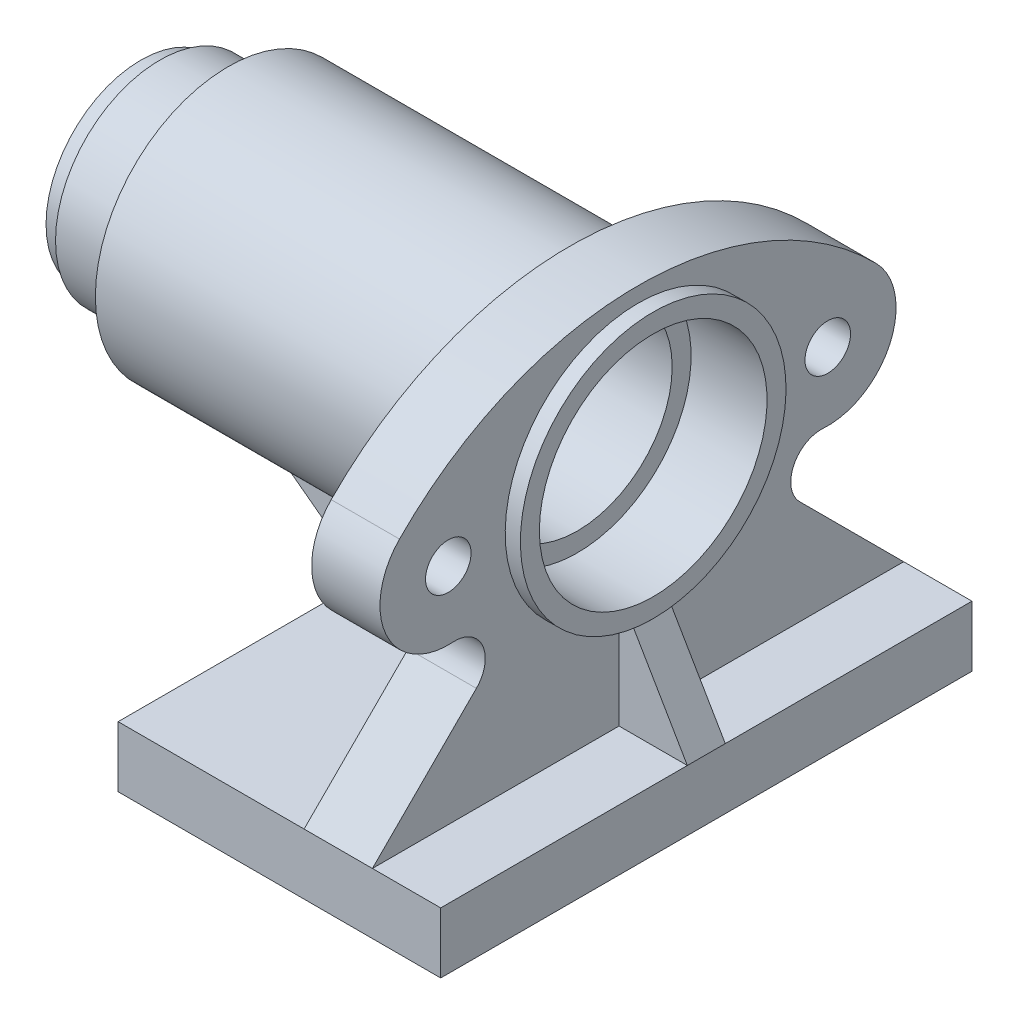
ISO-10303-21;
HEADER;
FILE_DESCRIPTION(('STEP AP214'),'2;1');
FILE_NAME('part.step','',(''),(''),'','','');
FILE_SCHEMA(('AUTOMOTIVE_DESIGN { 1 0 10303 214 1 1 1 1 }'));
ENDSEC;
DATA;
#1=APPLICATION_CONTEXT('core data for automotive mechanical design processes');
#2=APPLICATION_PROTOCOL_DEFINITION('international standard','automotive_design',2000,#1);
#3=PRODUCT_CONTEXT('',#1,'mechanical');
#4=PRODUCT('Part','Part','',(#3));
#5=PRODUCT_RELATED_PRODUCT_CATEGORY('part','',(#4));
#6=PRODUCT_DEFINITION_FORMATION('','',#4);
#7=PRODUCT_DEFINITION_CONTEXT('part definition',#1,'design');
#8=PRODUCT_DEFINITION('design','',#6,#7);
#9=PRODUCT_DEFINITION_SHAPE('','',#8);
#10=(LENGTH_UNIT() NAMED_UNIT(*) SI_UNIT(.MILLI.,.METRE.));
#11=(NAMED_UNIT(*) PLANE_ANGLE_UNIT() SI_UNIT($,.RADIAN.));
#12=(NAMED_UNIT(*) SI_UNIT($,.STERADIAN.) SOLID_ANGLE_UNIT());
#13=UNCERTAINTY_MEASURE_WITH_UNIT(LENGTH_MEASURE(1.E-05),#10,'distance_accuracy_value','');
#14=(GEOMETRIC_REPRESENTATION_CONTEXT(3) GLOBAL_UNCERTAINTY_ASSIGNED_CONTEXT((#13)) GLOBAL_UNIT_ASSIGNED_CONTEXT((#10,
#11,#12)) REPRESENTATION_CONTEXT('',''));
#15=CARTESIAN_POINT('',(0.,0.,0.));
#16=DIRECTION('',(0.,0.,1.));
#17=DIRECTION('',(1.,0.,0.));
#18=AXIS2_PLACEMENT_3D('',#15,#16,#17);
#19=CARTESIAN_POINT('',(0.,16.,70.));
#20=DIRECTION('',(0.,-1.,0.));
#21=DIRECTION('',(1.,0.,0.));
#22=AXIS2_PLACEMENT_3D('',#19,#20,#21);
#23=PLANE('',#22);
#24=DIRECTION('',(-1.,0.,0.));
#25=VECTOR('',#24,1.);
#26=CARTESIAN_POINT('',(0.,16.,-5.));
#27=LINE('',#26,#25);
#28=CARTESIAN_POINT('',(-36.,16.,-5.));
#29=VERTEX_POINT('',#28);
#30=CARTESIAN_POINT('',(-85.,16.,-5.));
#31=VERTEX_POINT('',#30);
#32=EDGE_CURVE('E196',#29,#31,#27,.T.);
#33=ORIENTED_EDGE('',*,*,#32,.F.);
#34=DIRECTION('',(0.,0.,-1.));
#35=VECTOR('',#34,1.);
#36=CARTESIAN_POINT('',(-36.,16.,70.));
#37=LINE('',#36,#35);
#38=CARTESIAN_POINT('',(-36.,16.,-70.));
#39=VERTEX_POINT('',#38);
#40=EDGE_CURVE('E37',#29,#39,#37,.T.);
#41=ORIENTED_EDGE('',*,*,#40,.T.);
#42=DIRECTION('',(-1.,0.,0.));
#43=VECTOR('',#42,1.);
#44=CARTESIAN_POINT('',(0.,16.,-70.));
#45=LINE('',#44,#43);
#46=CARTESIAN_POINT('',(-85.,16.,-70.));
#47=VERTEX_POINT('',#46);
#48=EDGE_CURVE('E385',#39,#47,#45,.T.);
#49=ORIENTED_EDGE('',*,*,#48,.T.);
#50=DIRECTION('',(0.,0.,-1.));
#51=VECTOR('',#50,1.);
#52=CARTESIAN_POINT('',(-85.,16.,70.));
#53=LINE('',#52,#51);
#54=EDGE_CURVE('E50',#31,#47,#53,.T.);
#55=ORIENTED_EDGE('',*,*,#54,.F.);
#56=EDGE_LOOP('',(#33,#41,#49,#55));
#57=FACE_BOUND('',#56,.T.);
#58=ADVANCED_FACE('F33',(#57),#23,.F.);
#59=DIRECTION('',(-1.,0.,0.));
#60=VECTOR('',#59,1.);
#61=CARTESIAN_POINT('',(0.,16.,-5.));
#62=LINE('',#61,#60);
#63=CARTESIAN_POINT('',(0.,16.,-5.));
#64=VERTEX_POINT('',#63);
#65=CARTESIAN_POINT('',(-18.,16.,-5.));
#66=VERTEX_POINT('',#65);
#67=EDGE_CURVE('E219',#64,#66,#62,.T.);
#68=ORIENTED_EDGE('',*,*,#67,.F.);
#69=DIRECTION('',(0.,0.,-1.));
#70=VECTOR('',#69,1.);
#71=CARTESIAN_POINT('',(0.,16.,70.));
#72=LINE('',#71,#70);
#73=CARTESIAN_POINT('',(0.,16.,-70.));
#74=VERTEX_POINT('',#73);
#75=EDGE_CURVE('E401',#64,#74,#72,.T.);
#76=ORIENTED_EDGE('',*,*,#75,.T.);
#77=CARTESIAN_POINT('',(-18.,16.,-70.));
#78=VERTEX_POINT('',#77);
#79=EDGE_CURVE('E388',#74,#78,#45,.T.);
#80=ORIENTED_EDGE('',*,*,#79,.T.);
#81=DIRECTION('',(0.,0.,-1.));
#82=VECTOR('',#81,1.);
#83=CARTESIAN_POINT('',(-18.,16.,70.));
#84=LINE('',#83,#82);
#85=EDGE_CURVE('E288',#66,#78,#84,.T.);
#86=ORIENTED_EDGE('',*,*,#85,.F.);
#87=EDGE_LOOP('',(#68,#76,#80,#86));
#88=FACE_BOUND('',#87,.T.);
#89=ADVANCED_FACE('F499',(#88),#23,.F.);
#90=CARTESIAN_POINT('',(0.,16.,70.));
#91=VERTEX_POINT('',#90);
#92=CARTESIAN_POINT('',(0.,16.,5.));
#93=VERTEX_POINT('',#92);
#94=EDGE_CURVE('E402',#91,#93,#72,.T.);
#95=ORIENTED_EDGE('',*,*,#94,.T.);
#96=DIRECTION('',(-1.,0.,0.));
#97=VECTOR('',#96,1.);
#98=CARTESIAN_POINT('',(0.,16.,5.));
#99=LINE('',#98,#97);
#100=CARTESIAN_POINT('',(-18.,16.,5.));
#101=VERTEX_POINT('',#100);
#102=EDGE_CURVE('E230',#93,#101,#99,.T.);
#103=ORIENTED_EDGE('',*,*,#102,.T.);
#104=CARTESIAN_POINT('',(-18.,16.,70.));
#105=VERTEX_POINT('',#104);
#106=EDGE_CURVE('E325',#105,#101,#84,.T.);
#107=ORIENTED_EDGE('',*,*,#106,.F.);
#108=DIRECTION('',(-1.,0.,0.));
#109=VECTOR('',#108,1.);
#110=CARTESIAN_POINT('',(0.,16.,70.));
#111=LINE('',#110,#109);
#112=EDGE_CURVE('E382',#91,#105,#111,.T.);
#113=ORIENTED_EDGE('',*,*,#112,.F.);
#114=EDGE_LOOP('',(#95,#103,#107,#113));
#115=FACE_BOUND('',#114,.T.);
#116=ADVANCED_FACE('F466',(#115),#23,.F.);
#117=CARTESIAN_POINT('',(-85.,0.,70.));
#118=DIRECTION('',(0.,1.,0.));
#119=DIRECTION('',(-1.,0.,0.));
#120=AXIS2_PLACEMENT_3D('',#117,#118,#119);
#121=PLANE('',#120);
#122=DIRECTION('',(1.,0.,0.));
#123=VECTOR('',#122,1.);
#124=CARTESIAN_POINT('',(-85.,0.,-70.));
#125=LINE('',#124,#123);
#126=CARTESIAN_POINT('',(-85.,0.,-70.));
#127=VERTEX_POINT('',#126);
#128=CARTESIAN_POINT('',(0.,0.,-70.));
#129=VERTEX_POINT('',#128);
#130=EDGE_CURVE('E316',#127,#129,#125,.T.);
#131=ORIENTED_EDGE('',*,*,#130,.T.);
#132=DIRECTION('',(0.,0.,-1.));
#133=VECTOR('',#132,1.);
#134=CARTESIAN_POINT('',(0.,0.,70.));
#135=LINE('',#134,#133);
#136=CARTESIAN_POINT('',(0.,0.,70.));
#137=VERTEX_POINT('',#136);
#138=EDGE_CURVE('E43',#137,#129,#135,.T.);
#139=ORIENTED_EDGE('',*,*,#138,.F.);
#140=DIRECTION('',(1.,0.,0.));
#141=VECTOR('',#140,1.);
#142=CARTESIAN_POINT('',(-85.,0.,70.));
#143=LINE('',#142,#141);
#144=CARTESIAN_POINT('',(-85.,0.,70.));
#145=VERTEX_POINT('',#144);
#146=EDGE_CURVE('E372',#145,#137,#143,.T.);
#147=ORIENTED_EDGE('',*,*,#146,.F.);
#148=DIRECTION('',(0.,0.,-1.));
#149=VECTOR('',#148,1.);
#150=CARTESIAN_POINT('',(-85.,0.,70.));
#151=LINE('',#150,#149);
#152=EDGE_CURVE('E397',#145,#127,#151,.T.);
#153=ORIENTED_EDGE('',*,*,#152,.T.);
#154=EDGE_LOOP('',(#131,#139,#147,#153));
#155=FACE_BOUND('',#154,.T.);
#156=ADVANCED_FACE('F35',(#155),#121,.F.);
#157=CARTESIAN_POINT('',(0.,0.,70.));
#158=DIRECTION('',(-1.,0.,0.));
#159=DIRECTION('',(0.,-1.,0.));
#160=AXIS2_PLACEMENT_3D('',#157,#158,#159);
#161=PLANE('',#160);
#162=ORIENTED_EDGE('',*,*,#138,.T.);
#163=DIRECTION('',(0.,1.,0.));
#164=VECTOR('',#163,1.);
#165=CARTESIAN_POINT('',(0.,0.,-70.));
#166=LINE('',#165,#164);
#167=EDGE_CURVE('E389',#129,#74,#166,.T.);
#168=ORIENTED_EDGE('',*,*,#167,.T.);
#169=ORIENTED_EDGE('',*,*,#75,.F.);
#170=DIRECTION('',(0.,0.,-1.));
#171=VECTOR('',#170,1.);
#172=CARTESIAN_POINT('',(0.,16.,70.));
#173=LINE('',#172,#171);
#174=EDGE_CURVE('E240',#93,#64,#173,.T.);
#175=ORIENTED_EDGE('',*,*,#174,.F.);
#176=ORIENTED_EDGE('',*,*,#94,.F.);
#177=DIRECTION('',(0.,1.,0.));
#178=VECTOR('',#177,1.);
#179=CARTESIAN_POINT('',(0.,0.,70.));
#180=LINE('',#179,#178);
#181=EDGE_CURVE('E375',#137,#91,#180,.T.);
#182=ORIENTED_EDGE('',*,*,#181,.F.);
#183=EDGE_LOOP('',(#162,#168,#169,#175,#176,#182));
#184=FACE_BOUND('',#183,.T.);
#185=ADVANCED_FACE('F408',(#184),#161,.F.);
#186=CARTESIAN_POINT('',(-36.,16.,70.));
#187=VERTEX_POINT('',#186);
#188=CARTESIAN_POINT('',(-36.,16.,5.));
#189=VERTEX_POINT('',#188);
#190=EDGE_CURVE('E296',#187,#189,#37,.T.);
#191=ORIENTED_EDGE('',*,*,#190,.T.);
#192=DIRECTION('',(-1.,0.,0.));
#193=VECTOR('',#192,1.);
#194=CARTESIAN_POINT('',(0.,16.,5.));
#195=LINE('',#194,#193);
#196=CARTESIAN_POINT('',(-85.,16.,5.));
#197=VERTEX_POINT('',#196);
#198=EDGE_CURVE('E58',#189,#197,#195,.T.);
#199=ORIENTED_EDGE('',*,*,#198,.T.);
#200=CARTESIAN_POINT('',(-85.,16.,70.));
#201=VERTEX_POINT('',#200);
#202=EDGE_CURVE('E399',#201,#197,#53,.T.);
#203=ORIENTED_EDGE('',*,*,#202,.F.);
#204=EDGE_CURVE('E300',#187,#201,#111,.T.);
#205=ORIENTED_EDGE('',*,*,#204,.F.);
#206=EDGE_LOOP('',(#191,#199,#203,#205));
#207=FACE_BOUND('',#206,.T.);
#208=ADVANCED_FACE('F501',(#207),#23,.F.);
#209=CARTESIAN_POINT('',(-85.,16.,70.));
#210=DIRECTION('',(1.,0.,0.));
#211=DIRECTION('',(0.,0.,-1.));
#212=AXIS2_PLACEMENT_3D('',#209,#210,#211);
#213=PLANE('',#212);
#214=ORIENTED_EDGE('',*,*,#202,.T.);
#215=DIRECTION('',(0.,0.,1.));
#216=VECTOR('',#215,1.);
#217=CARTESIAN_POINT('',(-85.,16.,70.));
#218=LINE('',#217,#216);
#219=EDGE_CURVE('E213',#197,#31,#218,.F.);
#220=ORIENTED_EDGE('',*,*,#219,.T.);
#221=ORIENTED_EDGE('',*,*,#54,.T.);
#222=DIRECTION('',(0.,-1.,0.));
#223=VECTOR('',#222,1.);
#224=CARTESIAN_POINT('',(-85.,16.,-70.));
#225=LINE('',#224,#223);
#226=EDGE_CURVE('E376',#47,#127,#225,.T.);
#227=ORIENTED_EDGE('',*,*,#226,.T.);
#228=ORIENTED_EDGE('',*,*,#152,.F.);
#229=DIRECTION('',(0.,-1.,0.));
#230=VECTOR('',#229,1.);
#231=CARTESIAN_POINT('',(-85.,16.,70.));
#232=LINE('',#231,#230);
#233=EDGE_CURVE('E379',#201,#145,#232,.T.);
#234=ORIENTED_EDGE('',*,*,#233,.F.);
#235=EDGE_LOOP('',(#214,#220,#221,#227,#228,#234));
#236=FACE_BOUND('',#235,.T.);
#237=ADVANCED_FACE('F423',(#236),#213,.F.);
#238=CARTESIAN_POINT('',(0.,0.,70.));
#239=DIRECTION('',(0.,0.,1.));
#240=DIRECTION('',(1.,0.,0.));
#241=AXIS2_PLACEMENT_3D('',#238,#239,#240);
#242=PLANE('',#241);
#243=ORIENTED_EDGE('',*,*,#146,.T.);
#244=ORIENTED_EDGE('',*,*,#181,.T.);
#245=ORIENTED_EDGE('',*,*,#112,.T.);
#246=DIRECTION('',(1.,0.,0.));
#247=VECTOR('',#246,1.);
#248=CARTESIAN_POINT('',(-36.,16.,70.));
#249=LINE('',#248,#247);
#250=EDGE_CURVE('E314',#187,#105,#249,.T.);
#251=ORIENTED_EDGE('',*,*,#250,.F.);
#252=ORIENTED_EDGE('',*,*,#204,.T.);
#253=ORIENTED_EDGE('',*,*,#233,.T.);
#254=EDGE_LOOP('',(#243,#244,#245,#251,#252,#253));
#255=FACE_BOUND('',#254,.T.);
#256=ADVANCED_FACE('F469',(#255),#242,.T.);
#257=CARTESIAN_POINT('',(0.,0.,-70.));
#258=DIRECTION('',(0.,0.,1.));
#259=DIRECTION('',(1.,0.,0.));
#260=AXIS2_PLACEMENT_3D('',#257,#258,#259);
#261=PLANE('',#260);
#262=ORIENTED_EDGE('',*,*,#130,.F.);
#263=ORIENTED_EDGE('',*,*,#226,.F.);
#264=ORIENTED_EDGE('',*,*,#48,.F.);
#265=DIRECTION('',(1.,0.,0.));
#266=VECTOR('',#265,1.);
#267=CARTESIAN_POINT('',(-36.,16.,-70.));
#268=LINE('',#267,#266);
#269=EDGE_CURVE('E307',#39,#78,#268,.T.);
#270=ORIENTED_EDGE('',*,*,#269,.T.);
#271=ORIENTED_EDGE('',*,*,#79,.F.);
#272=ORIENTED_EDGE('',*,*,#167,.F.);
#273=EDGE_LOOP('',(#262,#263,#264,#270,#271,#272));
#274=FACE_BOUND('',#273,.T.);
#275=ADVANCED_FACE('F417',(#274),#261,.F.);
#276=CARTESIAN_POINT('',(-36.,16.,70.));
#277=DIRECTION('',(0.,0.707106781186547,0.707106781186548));
#278=DIRECTION('',(0.,-0.707106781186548,0.707106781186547));
#279=AXIS2_PLACEMENT_3D('',#276,#277,#278);
#280=PLANE('',#279);
#281=DIRECTION('',(0.,-0.707106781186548,0.707106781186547));
#282=VECTOR('',#281,1.);
#283=CARTESIAN_POINT('',(-18.,16.,70.));
#284=LINE('',#283,#282);
#285=CARTESIAN_POINT('',(-18.,43.4017639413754,42.5982360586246));
#286=VERTEX_POINT('',#285);
#287=EDGE_CURVE('E330',#286,#105,#284,.T.);
#288=ORIENTED_EDGE('',*,*,#287,.F.);
#289=DIRECTION('',(1.,0.,0.));
#290=VECTOR('',#289,1.);
#291=CARTESIAN_POINT('',(-36.,43.4017639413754,42.5982360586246));
#292=LINE('',#291,#290);
#293=CARTESIAN_POINT('',(-36.,43.4017639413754,42.5982360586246));
#294=VERTEX_POINT('',#293);
#295=EDGE_CURVE('E317',#294,#286,#292,.T.);
#296=ORIENTED_EDGE('',*,*,#295,.F.);
#297=DIRECTION('',(0.,-0.707106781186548,0.707106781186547));
#298=VECTOR('',#297,1.);
#299=CARTESIAN_POINT('',(-36.,16.,70.));
#300=LINE('',#299,#298);
#301=EDGE_CURVE('E311',#294,#187,#300,.T.);
#302=ORIENTED_EDGE('',*,*,#301,.T.);
#303=ORIENTED_EDGE('',*,*,#250,.T.);
#304=EDGE_LOOP('',(#288,#296,#302,#303));
#305=FACE_BOUND('',#304,.T.);
#306=ADVANCED_FACE('F459',(#305),#280,.T.);
#307=CARTESIAN_POINT('',(-36.,49.0586181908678,48.255090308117));
#308=DIRECTION('',(1.,0.,0.));
#309=DIRECTION('',(0.,0.,-1.));
#310=AXIS2_PLACEMENT_3D('',#307,#308,#309);
#311=CYLINDRICAL_SURFACE('',#310,8.);
#312=CARTESIAN_POINT('',(-18.,49.0586181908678,48.255090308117));
#313=DIRECTION('',(-1.,0.,0.));
#314=DIRECTION('',(0.,0.,-1.));
#315=AXIS2_PLACEMENT_3D('',#312,#313,#314);
#316=CIRCLE('',#315,8.);
#317=CARTESIAN_POINT('',(-18.,57.0405818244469,48.7919855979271));
#318=VERTEX_POINT('',#317);
#319=EDGE_CURVE('E358',#318,#286,#316,.T.);
#320=ORIENTED_EDGE('',*,*,#319,.F.);
#321=DIRECTION('',(1.,0.,0.));
#322=VECTOR('',#321,1.);
#323=CARTESIAN_POINT('',(-36.,57.0405818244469,48.7919855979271));
#324=LINE('',#323,#322);
#325=CARTESIAN_POINT('',(-36.,57.0405818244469,48.7919855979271));
#326=VERTEX_POINT('',#325);
#327=EDGE_CURVE('E362',#326,#318,#324,.T.);
#328=ORIENTED_EDGE('',*,*,#327,.F.);
#329=CARTESIAN_POINT('',(-36.,49.0586181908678,48.255090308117));
#330=DIRECTION('',(-1.,0.,0.));
#331=DIRECTION('',(0.,0.,-1.));
#332=AXIS2_PLACEMENT_3D('',#329,#330,#331);
#333=CIRCLE('',#332,8.);
#334=EDGE_CURVE('E322',#326,#294,#333,.T.);
#335=ORIENTED_EDGE('',*,*,#334,.T.);
#336=ORIENTED_EDGE('',*,*,#295,.T.);
#337=EDGE_LOOP('',(#320,#328,#335,#336));
#338=FACE_BOUND('',#337,.T.);
#339=ADVANCED_FACE('F456',(#338),#311,.F.);
#340=CARTESIAN_POINT('',(-36.,75.,50.));
#341=DIRECTION('',(1.,0.,0.));
#342=DIRECTION('',(0.,0.,-1.));
#343=AXIS2_PLACEMENT_3D('',#340,#341,#342);
#344=CYLINDRICAL_SURFACE('',#343,18.);
#345=CARTESIAN_POINT('',(-18.,75.,50.));
#346=DIRECTION('',(1.,0.,0.));
#347=DIRECTION('',(0.,0.,1.));
#348=AXIS2_PLACEMENT_3D('',#345,#346,#347);
#349=CIRCLE('',#348,18.);
#350=CARTESIAN_POINT('',(-18.,87.5973758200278,62.8571428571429));
#351=VERTEX_POINT('',#350);
#352=EDGE_CURVE('E353',#351,#318,#349,.T.);
#353=ORIENTED_EDGE('',*,*,#352,.F.);
#354=DIRECTION('',(1.,0.,0.));
#355=VECTOR('',#354,1.);
#356=CARTESIAN_POINT('',(-36.,87.5973758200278,62.8571428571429));
#357=LINE('',#356,#355);
#358=CARTESIAN_POINT('',(-36.,87.5973758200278,62.8571428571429));
#359=VERTEX_POINT('',#358);
#360=EDGE_CURVE('E364',#359,#351,#357,.T.);
#361=ORIENTED_EDGE('',*,*,#360,.F.);
#362=CARTESIAN_POINT('',(-36.,75.,50.));
#363=DIRECTION('',(1.,0.,0.));
#364=DIRECTION('',(0.,0.,1.));
#365=AXIS2_PLACEMENT_3D('',#362,#363,#364);
#366=CIRCLE('',#365,18.);
#367=EDGE_CURVE('E452',#359,#326,#366,.T.);
#368=ORIENTED_EDGE('',*,*,#367,.T.);
#369=ORIENTED_EDGE('',*,*,#327,.T.);
#370=EDGE_LOOP('',(#353,#361,#368,#369));
#371=FACE_BOUND('',#370,.T.);
#372=ADVANCED_FACE('F449',(#371),#344,.T.);
#373=CARTESIAN_POINT('',(-36.,26.0102051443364,0.));
#374=DIRECTION('',(1.,0.,0.));
#375=DIRECTION('',(0.,0.,-1.));
#376=AXIS2_PLACEMENT_3D('',#373,#374,#375);
#377=CYLINDRICAL_SURFACE('',#376,88.);
#378=ORIENTED_EDGE('',*,*,#360,.T.);
#379=CARTESIAN_POINT('',(-18.,26.0102051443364,0.));
#380=DIRECTION('',(1.,0.,0.));
#381=DIRECTION('',(0.,0.,1.));
#382=AXIS2_PLACEMENT_3D('',#379,#380,#381);
#383=CIRCLE('',#382,88.);
#384=CARTESIAN_POINT('',(-18.,87.5973758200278,-62.8571428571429));
#385=VERTEX_POINT('',#384);
#386=EDGE_CURVE('E351',#385,#351,#383,.T.);
#387=ORIENTED_EDGE('',*,*,#386,.F.);
#388=DIRECTION('',(1.,0.,0.));
#389=VECTOR('',#388,1.);
#390=CARTESIAN_POINT('',(-36.,87.5973758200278,-62.8571428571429));
#391=LINE('',#390,#389);
#392=CARTESIAN_POINT('',(-36.,87.5973758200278,-62.8571428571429));
#393=VERTEX_POINT('',#392);
#394=EDGE_CURVE('E367',#393,#385,#391,.T.);
#395=ORIENTED_EDGE('',*,*,#394,.F.);
#396=CARTESIAN_POINT('',(-36.,26.0102051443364,0.));
#397=DIRECTION('',(1.,0.,0.));
#398=DIRECTION('',(0.,0.,1.));
#399=AXIS2_PLACEMENT_3D('',#396,#397,#398);
#400=CIRCLE('',#399,88.);
#401=EDGE_CURVE('E836',#393,#359,#400,.T.);
#402=ORIENTED_EDGE('',*,*,#401,.T.);
#403=EDGE_LOOP('',(#378,#387,#395,#402));
#404=FACE_BOUND('',#403,.T.);
#405=ADVANCED_FACE('F440',(#404),#377,.T.);
#406=CARTESIAN_POINT('',(-36.,75.,-50.));
#407=DIRECTION('',(1.,0.,0.));
#408=DIRECTION('',(0.,0.,-1.));
#409=AXIS2_PLACEMENT_3D('',#406,#407,#408);
#410=CYLINDRICAL_SURFACE('',#409,18.);
#411=CARTESIAN_POINT('',(-18.,75.,-50.));
#412=DIRECTION('',(1.,0.,0.));
#413=DIRECTION('',(0.,0.,-1.));
#414=AXIS2_PLACEMENT_3D('',#411,#412,#413);
#415=CIRCLE('',#414,18.);
#416=CARTESIAN_POINT('',(-18.,57.0405818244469,-48.7919855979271));
#417=VERTEX_POINT('',#416);
#418=EDGE_CURVE('E348',#417,#385,#415,.T.);
#419=ORIENTED_EDGE('',*,*,#418,.F.);
#420=DIRECTION('',(1.,0.,0.));
#421=VECTOR('',#420,1.);
#422=CARTESIAN_POINT('',(-36.,57.0405818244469,-48.7919855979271));
#423=LINE('',#422,#421);
#424=CARTESIAN_POINT('',(-36.,57.0405818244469,-48.7919855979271));
#425=VERTEX_POINT('',#424);
#426=EDGE_CURVE('E369',#425,#417,#423,.T.);
#427=ORIENTED_EDGE('',*,*,#426,.F.);
#428=CARTESIAN_POINT('',(-36.,75.,-50.));
#429=DIRECTION('',(1.,0.,0.));
#430=DIRECTION('',(0.,0.,-1.));
#431=AXIS2_PLACEMENT_3D('',#428,#429,#430);
#432=CIRCLE('',#431,18.);
#433=EDGE_CURVE('E437',#425,#393,#432,.T.);
#434=ORIENTED_EDGE('',*,*,#433,.T.);
#435=ORIENTED_EDGE('',*,*,#394,.T.);
#436=EDGE_LOOP('',(#419,#427,#434,#435));
#437=FACE_BOUND('',#436,.T.);
#438=ADVANCED_FACE('F435',(#437),#410,.T.);
#439=CARTESIAN_POINT('',(-36.,49.0586181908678,-48.255090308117));
#440=DIRECTION('',(1.,0.,0.));
#441=DIRECTION('',(0.,0.,-1.));
#442=AXIS2_PLACEMENT_3D('',#439,#440,#441);
#443=CYLINDRICAL_SURFACE('',#442,8.);
#444=CARTESIAN_POINT('',(-18.,49.0586181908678,-48.255090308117));
#445=DIRECTION('',(-1.,0.,0.));
#446=DIRECTION('',(0.,0.,1.));
#447=AXIS2_PLACEMENT_3D('',#444,#445,#446);
#448=CIRCLE('',#447,8.);
#449=CARTESIAN_POINT('',(-18.,43.4017639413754,-42.5982360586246));
#450=VERTEX_POINT('',#449);
#451=EDGE_CURVE('E336',#450,#417,#448,.T.);
#452=ORIENTED_EDGE('',*,*,#451,.F.);
#453=DIRECTION('',(1.,0.,0.));
#454=VECTOR('',#453,1.);
#455=CARTESIAN_POINT('',(-36.,43.4017639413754,-42.5982360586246));
#456=LINE('',#455,#454);
#457=CARTESIAN_POINT('',(-36.,43.4017639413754,-42.5982360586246));
#458=VERTEX_POINT('',#457);
#459=EDGE_CURVE('E310',#458,#450,#456,.T.);
#460=ORIENTED_EDGE('',*,*,#459,.F.);
#461=CARTESIAN_POINT('',(-36.,49.0586181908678,-48.255090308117));
#462=DIRECTION('',(-1.,0.,0.));
#463=DIRECTION('',(0.,0.,1.));
#464=AXIS2_PLACEMENT_3D('',#461,#462,#463);
#465=CIRCLE('',#464,8.);
#466=EDGE_CURVE('E292',#458,#425,#465,.T.);
#467=ORIENTED_EDGE('',*,*,#466,.T.);
#468=ORIENTED_EDGE('',*,*,#426,.T.);
#469=EDGE_LOOP('',(#452,#460,#467,#468));
#470=FACE_BOUND('',#469,.T.);
#471=ADVANCED_FACE('F432',(#470),#443,.F.);
#472=CARTESIAN_POINT('',(-36.,16.,-70.));
#473=DIRECTION('',(0.,0.707106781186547,-0.707106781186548));
#474=DIRECTION('',(0.,0.707106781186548,0.707106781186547));
#475=AXIS2_PLACEMENT_3D('',#472,#473,#474);
#476=PLANE('',#475);
#477=DIRECTION('',(0.,0.707106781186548,0.707106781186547));
#478=VECTOR('',#477,1.);
#479=CARTESIAN_POINT('',(-18.,16.,-70.));
#480=LINE('',#479,#478);
#481=EDGE_CURVE('E329',#78,#450,#480,.T.);
#482=ORIENTED_EDGE('',*,*,#481,.F.);
#483=ORIENTED_EDGE('',*,*,#269,.F.);
#484=DIRECTION('',(0.,0.707106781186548,0.707106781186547));
#485=VECTOR('',#484,1.);
#486=CARTESIAN_POINT('',(-36.,16.,-70.));
#487=LINE('',#486,#485);
#488=EDGE_CURVE('E299',#39,#458,#487,.T.);
#489=ORIENTED_EDGE('',*,*,#488,.T.);
#490=ORIENTED_EDGE('',*,*,#459,.T.);
#491=EDGE_LOOP('',(#482,#483,#489,#490));
#492=FACE_BOUND('',#491,.T.);
#493=ADVANCED_FACE('F430',(#492),#476,.T.);
#494=CARTESIAN_POINT('',(-36.,49.0586181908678,-48.255090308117));
#495=DIRECTION('',(-1.,0.,0.));
#496=DIRECTION('',(0.,0.,1.));
#497=AXIS2_PLACEMENT_3D('',#494,#495,#496);
#498=PLANE('',#497);
#499=DIRECTION('',(0.,1.,0.));
#500=VECTOR('',#499,1.);
#501=CARTESIAN_POINT('',(-36.,49.0586181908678,5.));
#502=LINE('',#501,#500);
#503=CARTESIAN_POINT('',(-36.,40.3589838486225,5.));
#504=VERTEX_POINT('',#503);
#505=EDGE_CURVE('E209',#189,#504,#502,.T.);
#506=ORIENTED_EDGE('',*,*,#505,.F.);
#507=ORIENTED_EDGE('',*,*,#190,.F.);
#508=ORIENTED_EDGE('',*,*,#301,.F.);
#509=ORIENTED_EDGE('',*,*,#334,.F.);
#510=ORIENTED_EDGE('',*,*,#367,.F.);
#511=ORIENTED_EDGE('',*,*,#401,.F.);
#512=ORIENTED_EDGE('',*,*,#433,.F.);
#513=ORIENTED_EDGE('',*,*,#466,.F.);
#514=ORIENTED_EDGE('',*,*,#488,.F.);
#515=ORIENTED_EDGE('',*,*,#40,.F.);
#516=DIRECTION('',(0.,1.,0.));
#517=VECTOR('',#516,1.);
#518=CARTESIAN_POINT('',(-36.,49.0586181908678,-5.));
#519=LINE('',#518,#517);
#520=CARTESIAN_POINT('',(-36.,40.3589838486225,-5.));
#521=VERTEX_POINT('',#520);
#522=EDGE_CURVE('E190',#29,#521,#519,.T.);
#523=ORIENTED_EDGE('',*,*,#522,.T.);
#524=CARTESIAN_POINT('',(-36.,75.,0.));
#525=DIRECTION('',(-1.,0.,0.));
#526=DIRECTION('',(0.,0.,1.));
#527=AXIS2_PLACEMENT_3D('',#524,#525,#526);
#528=CIRCLE('',#527,35.);
#529=EDGE_CURVE('E175',#521,#504,#528,.F.);
#530=ORIENTED_EDGE('',*,*,#529,.T.);
#531=EDGE_LOOP('',(#506,#507,#508,#509,#510,#511,#512,#513,#514,#515,#523,#530));
#532=FACE_BOUND('',#531,.T.);
#533=CARTESIAN_POINT('',(-36.,75.,50.));
#534=DIRECTION('',(1.,0.,0.));
#535=DIRECTION('',(0.,0.,-1.));
#536=AXIS2_PLACEMENT_3D('',#533,#534,#535);
#537=CIRCLE('',#536,6.);
#538=CARTESIAN_POINT('',(-36.,75.,44.));
#539=VERTEX_POINT('',#538);
#540=EDGE_CURVE('E285',#539,#539,#537,.T.);
#541=ORIENTED_EDGE('',*,*,#540,.T.);
#542=EDGE_LOOP('',(#541));
#543=FACE_BOUND('',#542,.T.);
#544=CARTESIAN_POINT('',(-36.,75.,-50.));
#545=DIRECTION('',(1.,0.,0.));
#546=DIRECTION('',(0.,0.,1.));
#547=AXIS2_PLACEMENT_3D('',#544,#545,#546);
#548=CIRCLE('',#547,6.);
#549=CARTESIAN_POINT('',(-36.,75.,-44.));
#550=VERTEX_POINT('',#549);
#551=EDGE_CURVE('E279',#550,#550,#548,.T.);
#552=ORIENTED_EDGE('',*,*,#551,.T.);
#553=EDGE_LOOP('',(#552));
#554=FACE_BOUND('',#553,.T.);
#555=ADVANCED_FACE('F191',(#532,#543,#554),#498,.T.);
#556=CARTESIAN_POINT('',(-18.,49.0586181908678,-48.255090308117));
#557=DIRECTION('',(-1.,0.,0.));
#558=DIRECTION('',(0.,0.,1.));
#559=AXIS2_PLACEMENT_3D('',#556,#557,#558);
#560=PLANE('',#559);
#561=CARTESIAN_POINT('',(-18.,75.,50.));
#562=DIRECTION('',(1.,0.,0.));
#563=DIRECTION('',(0.,0.,-1.));
#564=AXIS2_PLACEMENT_3D('',#561,#562,#563);
#565=CIRCLE('',#564,6.);
#566=CARTESIAN_POINT('',(-18.,75.,44.));
#567=VERTEX_POINT('',#566);
#568=EDGE_CURVE('E282',#567,#567,#565,.T.);
#569=ORIENTED_EDGE('',*,*,#568,.F.);
#570=EDGE_LOOP('',(#569));
#571=FACE_BOUND('',#570,.T.);
#572=DIRECTION('',(0.,1.,0.));
#573=VECTOR('',#572,1.);
#574=CARTESIAN_POINT('',(-18.,49.0586181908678,5.));
#575=LINE('',#574,#573);
#576=CARTESIAN_POINT('',(-18.,40.3589838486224,5.));
#577=VERTEX_POINT('',#576);
#578=EDGE_CURVE('E232',#101,#577,#575,.T.);
#579=ORIENTED_EDGE('',*,*,#578,.T.);
#580=CARTESIAN_POINT('',(-18.,75.,0.));
#581=DIRECTION('',(1.,0.,0.));
#582=DIRECTION('',(0.,0.,-1.));
#583=AXIS2_PLACEMENT_3D('',#580,#581,#582);
#584=CIRCLE('',#583,35.);
#585=CARTESIAN_POINT('',(-18.,40.3589838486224,-5.));
#586=VERTEX_POINT('',#585);
#587=EDGE_CURVE('E185',#586,#577,#584,.T.);
#588=ORIENTED_EDGE('',*,*,#587,.F.);
#589=DIRECTION('',(0.,1.,0.));
#590=VECTOR('',#589,1.);
#591=CARTESIAN_POINT('',(-18.,49.0586181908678,-5.));
#592=LINE('',#591,#590);
#593=EDGE_CURVE('E224',#66,#586,#592,.T.);
#594=ORIENTED_EDGE('',*,*,#593,.F.);
#595=ORIENTED_EDGE('',*,*,#85,.T.);
#596=ORIENTED_EDGE('',*,*,#481,.T.);
#597=ORIENTED_EDGE('',*,*,#451,.T.);
#598=ORIENTED_EDGE('',*,*,#418,.T.);
#599=ORIENTED_EDGE('',*,*,#386,.T.);
#600=ORIENTED_EDGE('',*,*,#352,.T.);
#601=ORIENTED_EDGE('',*,*,#319,.T.);
#602=ORIENTED_EDGE('',*,*,#287,.T.);
#603=ORIENTED_EDGE('',*,*,#106,.T.);
#604=EDGE_LOOP('',(#579,#588,#594,#595,#596,#597,#598,#599,#600,#601,#602,#603));
#605=FACE_BOUND('',#604,.T.);
#606=CARTESIAN_POINT('',(-18.,75.,-50.));
#607=DIRECTION('',(1.,0.,0.));
#608=DIRECTION('',(0.,0.,1.));
#609=AXIS2_PLACEMENT_3D('',#606,#607,#608);
#610=CIRCLE('',#609,6.);
#611=CARTESIAN_POINT('',(-18.,75.,-44.));
#612=VERTEX_POINT('',#611);
#613=EDGE_CURVE('E278',#612,#612,#610,.T.);
#614=ORIENTED_EDGE('',*,*,#613,.F.);
#615=EDGE_LOOP('',(#614));
#616=FACE_BOUND('',#615,.T.);
#617=ADVANCED_FACE('F443',(#571,#605,#616),#560,.F.);
#618=CARTESIAN_POINT('',(-36.,75.,50.));
#619=DIRECTION('',(1.,0.,0.));
#620=DIRECTION('',(0.,0.,-1.));
#621=AXIS2_PLACEMENT_3D('',#618,#619,#620);
#622=CYLINDRICAL_SURFACE('',#621,6.);
#623=ORIENTED_EDGE('',*,*,#540,.F.);
#624=EDGE_LOOP('',(#623));
#625=FACE_BOUND('',#624,.T.);
#626=ORIENTED_EDGE('',*,*,#568,.T.);
#627=EDGE_LOOP('',(#626));
#628=FACE_BOUND('',#627,.T.);
#629=ADVANCED_FACE('F565',(#625,#628),#622,.F.);
#630=CARTESIAN_POINT('',(-36.,75.,-50.));
#631=DIRECTION('',(1.,0.,0.));
#632=DIRECTION('',(0.,0.,-1.));
#633=AXIS2_PLACEMENT_3D('',#630,#631,#632);
#634=CYLINDRICAL_SURFACE('',#633,6.);
#635=ORIENTED_EDGE('',*,*,#551,.F.);
#636=EDGE_LOOP('',(#635));
#637=FACE_BOUND('',#636,.T.);
#638=ORIENTED_EDGE('',*,*,#613,.T.);
#639=EDGE_LOOP('',(#638));
#640=FACE_BOUND('',#639,.T.);
#641=ADVANCED_FACE('F578',(#637,#640),#634,.F.);
#642=CARTESIAN_POINT('',(-107.067924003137,75.,0.));
#643=DIRECTION('',(-1.,0.,0.));
#644=DIRECTION('',(0.,0.,1.));
#645=AXIS2_PLACEMENT_3D('',#642,#643,#644);
#646=CYLINDRICAL_SURFACE('',#645,35.);
#647=CARTESIAN_POINT('',(-34.4166666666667,75.,0.));
#648=DIRECTION('',(0.863778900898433,0.503871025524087,0.));
#649=DIRECTION('',(-0.503871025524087,0.863778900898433,0.));
#650=AXIS2_PLACEMENT_3D('',#647,#648,#649);
#651=ELLIPSE('',#650,40.5196283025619,35.);
#652=CARTESIAN_POINT('',(-14.,40.,0.));
#653=VERTEX_POINT('',#652);
#654=CARTESIAN_POINT('',(-14.2094072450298,40.3589838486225,-5.));
#655=VERTEX_POINT('',#654);
#656=EDGE_CURVE('E237',#653,#655,#651,.T.);
#657=ORIENTED_EDGE('',*,*,#656,.T.);
#658=DIRECTION('',(-1.,0.,0.));
#659=VECTOR('',#658,1.);
#660=CARTESIAN_POINT('',(-107.067924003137,40.3589838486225,-5.));
#661=LINE('',#660,#659);
#662=EDGE_CURVE('E227',#586,#655,#661,.F.);
#663=ORIENTED_EDGE('',*,*,#662,.F.);
#664=ORIENTED_EDGE('',*,*,#587,.T.);
#665=DIRECTION('',(-1.,0.,0.));
#666=VECTOR('',#665,1.);
#667=CARTESIAN_POINT('',(-107.067924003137,40.3589838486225,5.));
#668=LINE('',#667,#666);
#669=CARTESIAN_POINT('',(-14.2094072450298,40.3589838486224,5.));
#670=VERTEX_POINT('',#669);
#671=EDGE_CURVE('E235',#577,#670,#668,.F.);
#672=ORIENTED_EDGE('',*,*,#671,.T.);
#673=EDGE_CURVE('E239',#670,#653,#651,.T.);
#674=ORIENTED_EDGE('',*,*,#673,.T.);
#675=CARTESIAN_POINT('',(-14.,75.,0.));
#676=DIRECTION('',(-1.,0.,0.));
#677=DIRECTION('',(0.,0.,1.));
#678=AXIS2_PLACEMENT_3D('',#675,#676,#677);
#679=CIRCLE('',#678,35.);
#680=EDGE_CURVE('E249',#653,#653,#679,.T.);
#681=ORIENTED_EDGE('',*,*,#680,.T.);
#682=EDGE_LOOP('',(#657,#663,#664,#672,#674,#681));
#683=FACE_BOUND('',#682,.T.);
#684=ADVANCED_FACE('F482',(#683),#646,.T.);
#685=CARTESIAN_POINT('',(-34.,100.,0.));
#686=DIRECTION('',(-1.,0.,0.));
#687=DIRECTION('',(0.,0.,1.));
#688=AXIS2_PLACEMENT_3D('',#685,#686,#687);
#689=PLANE('',#688);
#690=CARTESIAN_POINT('',(-34.,75.,0.));
#691=DIRECTION('',(-1.,0.,0.));
#692=DIRECTION('',(0.,0.,1.));
#693=AXIS2_PLACEMENT_3D('',#690,#691,#692);
#694=CIRCLE('',#693,25.);
#695=CARTESIAN_POINT('',(-34.,75.,25.));
#696=VERTEX_POINT('',#695);
#697=EDGE_CURVE('E186',#696,#696,#694,.T.);
#698=ORIENTED_EDGE('',*,*,#697,.T.);
#699=EDGE_LOOP('',(#698));
#700=FACE_BOUND('',#699,.T.);
#701=CARTESIAN_POINT('',(-34.,75.,0.));
#702=DIRECTION('',(-1.,0.,0.));
#703=DIRECTION('',(0.,0.,1.));
#704=AXIS2_PLACEMENT_3D('',#701,#702,#703);
#705=CIRCLE('',#704,30.);
#706=CARTESIAN_POINT('',(-34.,75.,30.));
#707=VERTEX_POINT('',#706);
#708=EDGE_CURVE('E243',#707,#707,#705,.T.);
#709=ORIENTED_EDGE('',*,*,#708,.F.);
#710=EDGE_LOOP('',(#709));
#711=FACE_BOUND('',#710,.T.);
#712=ADVANCED_FACE('F577',(#700,#711),#689,.F.);
#713=CARTESIAN_POINT('',(-107.067924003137,75.,0.));
#714=DIRECTION('',(-1.,0.,0.));
#715=DIRECTION('',(0.,0.,1.));
#716=AXIS2_PLACEMENT_3D('',#713,#714,#715);
#717=CYLINDRICAL_SURFACE('',#716,25.);
#718=ORIENTED_EDGE('',*,*,#697,.F.);
#719=EDGE_LOOP('',(#718));
#720=FACE_BOUND('',#719,.T.);
#721=CARTESIAN_POINT('',(-114.,75.,0.));
#722=DIRECTION('',(-1.,0.,0.));
#723=DIRECTION('',(0.,0.,1.));
#724=AXIS2_PLACEMENT_3D('',#721,#722,#723);
#725=CIRCLE('',#724,25.);
#726=CARTESIAN_POINT('',(-114.,75.,25.));
#727=VERTEX_POINT('',#726);
#728=EDGE_CURVE('E272',#727,#727,#725,.T.);
#729=ORIENTED_EDGE('',*,*,#728,.T.);
#730=EDGE_LOOP('',(#729));
#731=FACE_BOUND('',#730,.T.);
#732=ADVANCED_FACE('F588',(#720,#731),#717,.F.);
#733=CARTESIAN_POINT('',(-114.,100.,0.));
#734=DIRECTION('',(-1.,0.,0.));
#735=DIRECTION('',(0.,0.,1.));
#736=AXIS2_PLACEMENT_3D('',#733,#734,#735);
#737=PLANE('',#736);
#738=CARTESIAN_POINT('',(-114.,75.,0.));
#739=DIRECTION('',(-1.,0.,0.));
#740=DIRECTION('',(0.,0.,1.));
#741=AXIS2_PLACEMENT_3D('',#738,#739,#740);
#742=CIRCLE('',#741,16.);
#743=CARTESIAN_POINT('',(-114.,75.,16.));
#744=VERTEX_POINT('',#743);
#745=EDGE_CURVE('E269',#744,#744,#742,.T.);
#746=ORIENTED_EDGE('',*,*,#745,.T.);
#747=EDGE_LOOP('',(#746));
#748=FACE_BOUND('',#747,.T.);
#749=ORIENTED_EDGE('',*,*,#728,.F.);
#750=EDGE_LOOP('',(#749));
#751=FACE_BOUND('',#750,.T.);
#752=ADVANCED_FACE('F598',(#748,#751),#737,.F.);
#753=CARTESIAN_POINT('',(-107.067924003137,75.,0.));
#754=DIRECTION('',(-1.,0.,0.));
#755=DIRECTION('',(0.,0.,1.));
#756=AXIS2_PLACEMENT_3D('',#753,#754,#755);
#757=CYLINDRICAL_SURFACE('',#756,16.);
#758=ORIENTED_EDGE('',*,*,#745,.F.);
#759=EDGE_LOOP('',(#758));
#760=FACE_BOUND('',#759,.T.);
#761=CARTESIAN_POINT('',(-149.,75.,0.));
#762=DIRECTION('',(-1.,0.,0.));
#763=DIRECTION('',(0.,0.,1.));
#764=AXIS2_PLACEMENT_3D('',#761,#762,#763);
#765=CIRCLE('',#764,16.);
#766=CARTESIAN_POINT('',(-149.,75.,16.));
#767=VERTEX_POINT('',#766);
#768=EDGE_CURVE('E266',#767,#767,#765,.T.);
#769=ORIENTED_EDGE('',*,*,#768,.T.);
#770=EDGE_LOOP('',(#769));
#771=FACE_BOUND('',#770,.T.);
#772=ADVANCED_FACE('F608',(#760,#771),#757,.F.);
#773=CARTESIAN_POINT('',(-149.,91.,0.));
#774=DIRECTION('',(1.,0.,0.));
#775=DIRECTION('',(0.,0.,-1.));
#776=AXIS2_PLACEMENT_3D('',#773,#774,#775);
#777=PLANE('',#776);
#778=ORIENTED_EDGE('',*,*,#768,.F.);
#779=EDGE_LOOP('',(#778));
#780=FACE_BOUND('',#779,.T.);
#781=CARTESIAN_POINT('',(-149.,75.,0.));
#782=DIRECTION('',(-1.,0.,0.));
#783=DIRECTION('',(0.,0.,1.));
#784=AXIS2_PLACEMENT_3D('',#781,#782,#783);
#785=CIRCLE('',#784,25.);
#786=CARTESIAN_POINT('',(-149.,75.,25.));
#787=VERTEX_POINT('',#786);
#788=EDGE_CURVE('E263',#787,#787,#785,.T.);
#789=ORIENTED_EDGE('',*,*,#788,.T.);
#790=EDGE_LOOP('',(#789));
#791=FACE_BOUND('',#790,.T.);
#792=ADVANCED_FACE('F618',(#780,#791),#777,.F.);
#793=CARTESIAN_POINT('',(-107.067924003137,75.,0.));
#794=DIRECTION('',(-1.,0.,0.));
#795=DIRECTION('',(0.,0.,1.));
#796=AXIS2_PLACEMENT_3D('',#793,#794,#795);
#797=CYLINDRICAL_SURFACE('',#796,25.);
#798=ORIENTED_EDGE('',*,*,#788,.F.);
#799=EDGE_LOOP('',(#798));
#800=FACE_BOUND('',#799,.T.);
#801=CARTESIAN_POINT('',(-144.,75.,0.));
#802=DIRECTION('',(-1.,0.,0.));
#803=DIRECTION('',(0.,0.,1.));
#804=AXIS2_PLACEMENT_3D('',#801,#802,#803);
#805=CIRCLE('',#804,25.);
#806=CARTESIAN_POINT('',(-144.,75.,25.));
#807=VERTEX_POINT('',#806);
#808=EDGE_CURVE('E260',#807,#807,#805,.T.);
#809=ORIENTED_EDGE('',*,*,#808,.T.);
#810=EDGE_LOOP('',(#809));
#811=FACE_BOUND('',#810,.T.);
#812=ADVANCED_FACE('F628',(#800,#811),#797,.T.);
#813=CARTESIAN_POINT('',(-144.,100.,0.));
#814=DIRECTION('',(1.,0.,0.));
#815=DIRECTION('',(0.,0.,-1.));
#816=AXIS2_PLACEMENT_3D('',#813,#814,#815);
#817=PLANE('',#816);
#818=ORIENTED_EDGE('',*,*,#808,.F.);
#819=EDGE_LOOP('',(#818));
#820=FACE_BOUND('',#819,.T.);
#821=CARTESIAN_POINT('',(-144.,75.,0.));
#822=DIRECTION('',(-1.,0.,0.));
#823=DIRECTION('',(0.,0.,1.));
#824=AXIS2_PLACEMENT_3D('',#821,#822,#823);
#825=CIRCLE('',#824,27.5);
#826=CARTESIAN_POINT('',(-144.,75.,27.5));
#827=VERTEX_POINT('',#826);
#828=EDGE_CURVE('E257',#827,#827,#825,.T.);
#829=ORIENTED_EDGE('',*,*,#828,.T.);
#830=EDGE_LOOP('',(#829));
#831=FACE_BOUND('',#830,.T.);
#832=ADVANCED_FACE('F638',(#820,#831),#817,.F.);
#833=CARTESIAN_POINT('',(-107.067924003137,75.,0.));
#834=DIRECTION('',(-1.,0.,0.));
#835=DIRECTION('',(0.,0.,1.));
#836=AXIS2_PLACEMENT_3D('',#833,#834,#835);
#837=CYLINDRICAL_SURFACE('',#836,27.5);
#838=ORIENTED_EDGE('',*,*,#828,.F.);
#839=EDGE_LOOP('',(#838));
#840=FACE_BOUND('',#839,.T.);
#841=CARTESIAN_POINT('',(-126.,75.,0.));
#842=DIRECTION('',(-1.,0.,0.));
#843=DIRECTION('',(0.,0.,1.));
#844=AXIS2_PLACEMENT_3D('',#841,#842,#843);
#845=CIRCLE('',#844,27.5);
#846=CARTESIAN_POINT('',(-126.,75.,27.5));
#847=VERTEX_POINT('',#846);
#848=EDGE_CURVE('E254',#847,#847,#845,.T.);
#849=ORIENTED_EDGE('',*,*,#848,.T.);
#850=EDGE_LOOP('',(#849));
#851=FACE_BOUND('',#850,.T.);
#852=ADVANCED_FACE('F648',(#840,#851),#837,.T.);
#853=CARTESIAN_POINT('',(-126.,102.5,0.));
#854=DIRECTION('',(1.,0.,0.));
#855=DIRECTION('',(0.,0.,-1.));
#856=AXIS2_PLACEMENT_3D('',#853,#854,#855);
#857=PLANE('',#856);
#858=ORIENTED_EDGE('',*,*,#848,.F.);
#859=EDGE_LOOP('',(#858));
#860=FACE_BOUND('',#859,.T.);
#861=CARTESIAN_POINT('',(-126.,75.,0.));
#862=DIRECTION('',(-1.,0.,0.));
#863=DIRECTION('',(0.,0.,1.));
#864=AXIS2_PLACEMENT_3D('',#861,#862,#863);
#865=CIRCLE('',#864,35.);
#866=CARTESIAN_POINT('',(-126.,75.,35.));
#867=VERTEX_POINT('',#866);
#868=EDGE_CURVE('E251',#867,#867,#865,.T.);
#869=ORIENTED_EDGE('',*,*,#868,.T.);
#870=EDGE_LOOP('',(#869));
#871=FACE_BOUND('',#870,.T.);
#872=ADVANCED_FACE('F495',(#860,#871),#857,.F.);
#873=ORIENTED_EDGE('',*,*,#868,.F.);
#874=EDGE_LOOP('',(#873));
#875=FACE_BOUND('',#874,.T.);
#876=DIRECTION('',(-1.,0.,0.));
#877=VECTOR('',#876,1.);
#878=CARTESIAN_POINT('',(-107.067924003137,40.3589838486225,5.));
#879=LINE('',#878,#877);
#880=CARTESIAN_POINT('',(-117.478645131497,40.3589838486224,5.));
#881=VERTEX_POINT('',#880);
#882=EDGE_CURVE('E182',#881,#504,#879,.F.);
#883=ORIENTED_EDGE('',*,*,#882,.T.);
#884=ORIENTED_EDGE('',*,*,#529,.F.);
#885=DIRECTION('',(-1.,0.,0.));
#886=VECTOR('',#885,1.);
#887=CARTESIAN_POINT('',(-107.067924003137,40.3589838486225,-5.));
#888=LINE('',#887,#886);
#889=CARTESIAN_POINT('',(-117.478645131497,40.3589838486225,-5.));
#890=VERTEX_POINT('',#889);
#891=EDGE_CURVE('E179',#890,#521,#888,.F.);
#892=ORIENTED_EDGE('',*,*,#891,.F.);
#893=CARTESIAN_POINT('',(-163.666666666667,75.,0.));
#894=DIRECTION('',(0.6,0.8,0.));
#895=DIRECTION('',(-0.8,0.6,0.));
#896=AXIS2_PLACEMENT_3D('',#893,#894,#895);
#897=ELLIPSE('',#896,58.3333333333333,35.);
#898=EDGE_CURVE('E11',#890,#881,#897,.F.);
#899=ORIENTED_EDGE('',*,*,#898,.T.);
#900=EDGE_LOOP('',(#883,#884,#892,#899));
#901=FACE_BOUND('',#900,.T.);
#902=ADVANCED_FACE('F177',(#875,#901),#646,.T.);
#903=CARTESIAN_POINT('',(-14.,110.,0.));
#904=DIRECTION('',(-1.,0.,0.));
#905=DIRECTION('',(0.,0.,1.));
#906=AXIS2_PLACEMENT_3D('',#903,#904,#905);
#907=PLANE('',#906);
#908=CARTESIAN_POINT('',(-14.,75.,0.));
#909=DIRECTION('',(-1.,0.,0.));
#910=DIRECTION('',(0.,0.,1.));
#911=AXIS2_PLACEMENT_3D('',#908,#909,#910);
#912=CIRCLE('',#911,30.);
#913=CARTESIAN_POINT('',(-14.,75.,30.));
#914=VERTEX_POINT('',#913);
#915=EDGE_CURVE('E246',#914,#914,#912,.T.);
#916=ORIENTED_EDGE('',*,*,#915,.T.);
#917=EDGE_LOOP('',(#916));
#918=FACE_BOUND('',#917,.T.);
#919=ORIENTED_EDGE('',*,*,#680,.F.);
#920=EDGE_LOOP('',(#919));
#921=FACE_BOUND('',#920,.T.);
#922=ADVANCED_FACE('F484',(#918,#921),#907,.F.);
#923=CARTESIAN_POINT('',(-107.067924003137,75.,0.));
#924=DIRECTION('',(-1.,0.,0.));
#925=DIRECTION('',(0.,0.,1.));
#926=AXIS2_PLACEMENT_3D('',#923,#924,#925);
#927=CYLINDRICAL_SURFACE('',#926,30.);
#928=ORIENTED_EDGE('',*,*,#915,.F.);
#929=EDGE_LOOP('',(#928));
#930=FACE_BOUND('',#929,.T.);
#931=ORIENTED_EDGE('',*,*,#708,.T.);
#932=EDGE_LOOP('',(#931));
#933=FACE_BOUND('',#932,.T.);
#934=ADVANCED_FACE('F486',(#930,#933),#927,.F.);
#935=CARTESIAN_POINT('',(0.,16.,0.));
#936=DIRECTION('',(0.863778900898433,0.503871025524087,0.));
#937=DIRECTION('',(-0.503871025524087,0.863778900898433,0.));
#938=AXIS2_PLACEMENT_3D('',#935,#936,#937);
#939=PLANE('',#938);
#940=DIRECTION('',(-0.503871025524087,0.863778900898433,0.));
#941=VECTOR('',#940,1.);
#942=CARTESIAN_POINT('',(0.,16.,5.));
#943=LINE('',#942,#941);
#944=EDGE_CURVE('E216',#93,#670,#943,.T.);
#945=ORIENTED_EDGE('',*,*,#944,.F.);
#946=ORIENTED_EDGE('',*,*,#174,.T.);
#947=DIRECTION('',(-0.503871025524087,0.863778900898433,0.));
#948=VECTOR('',#947,1.);
#949=CARTESIAN_POINT('',(0.,16.,-5.));
#950=LINE('',#949,#948);
#951=EDGE_CURVE('E215',#64,#655,#950,.T.);
#952=ORIENTED_EDGE('',*,*,#951,.T.);
#953=ORIENTED_EDGE('',*,*,#656,.F.);
#954=ORIENTED_EDGE('',*,*,#673,.F.);
#955=EDGE_LOOP('',(#945,#946,#952,#953,#954));
#956=FACE_BOUND('',#955,.T.);
#957=ADVANCED_FACE('F476',(#956),#939,.T.);
#958=CARTESIAN_POINT('',(-74.4999875,57.0051025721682,5.));
#959=DIRECTION('',(0.,0.,1.));
#960=DIRECTION('',(1.,0.,0.));
#961=AXIS2_PLACEMENT_3D('',#958,#959,#960);
#962=PLANE('',#961);
#963=ORIENTED_EDGE('',*,*,#671,.F.);
#964=ORIENTED_EDGE('',*,*,#578,.F.);
#965=ORIENTED_EDGE('',*,*,#102,.F.);
#966=ORIENTED_EDGE('',*,*,#944,.T.);
#967=EDGE_LOOP('',(#963,#964,#965,#966));
#968=FACE_BOUND('',#967,.T.);
#969=ADVANCED_FACE('F473',(#968),#962,.T.);
#970=CARTESIAN_POINT('',(-74.4999875,57.0051025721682,-5.));
#971=DIRECTION('',(0.,0.,1.));
#972=DIRECTION('',(1.,0.,0.));
#973=AXIS2_PLACEMENT_3D('',#970,#971,#972);
#974=PLANE('',#973);
#975=ORIENTED_EDGE('',*,*,#593,.T.);
#976=ORIENTED_EDGE('',*,*,#662,.T.);
#977=ORIENTED_EDGE('',*,*,#951,.F.);
#978=ORIENTED_EDGE('',*,*,#67,.T.);
#979=EDGE_LOOP('',(#975,#976,#977,#978));
#980=FACE_BOUND('',#979,.T.);
#981=ADVANCED_FACE('F696',(#980),#974,.F.);
#982=CARTESIAN_POINT('',(-85.,16.,0.));
#983=DIRECTION('',(0.6,0.8,0.));
#984=DIRECTION('',(-0.8,0.6,0.));
#985=AXIS2_PLACEMENT_3D('',#982,#983,#984);
#986=PLANE('',#985);
#987=ORIENTED_EDGE('',*,*,#219,.F.);
#988=DIRECTION('',(-0.8,0.6,0.));
#989=VECTOR('',#988,1.);
#990=CARTESIAN_POINT('',(-85.,16.,5.));
#991=LINE('',#990,#989);
#992=EDGE_CURVE('E202',#197,#881,#991,.T.);
#993=ORIENTED_EDGE('',*,*,#992,.T.);
#994=ORIENTED_EDGE('',*,*,#898,.F.);
#995=DIRECTION('',(-0.8,0.6,0.));
#996=VECTOR('',#995,1.);
#997=CARTESIAN_POINT('',(-85.,16.,-5.));
#998=LINE('',#997,#996);
#999=EDGE_CURVE('E201',#31,#890,#998,.T.);
#1000=ORIENTED_EDGE('',*,*,#999,.F.);
#1001=EDGE_LOOP('',(#987,#993,#994,#1000));
#1002=FACE_BOUND('',#1001,.T.);
#1003=ADVANCED_FACE('F690',(#1002),#986,.F.);
#1004=CARTESIAN_POINT('',(-74.4999875,57.0051025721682,5.));
#1005=DIRECTION('',(0.,0.,1.));
#1006=DIRECTION('',(1.,0.,0.));
#1007=AXIS2_PLACEMENT_3D('',#1004,#1005,#1006);
#1008=PLANE('',#1007);
#1009=ORIENTED_EDGE('',*,*,#198,.F.);
#1010=ORIENTED_EDGE('',*,*,#505,.T.);
#1011=ORIENTED_EDGE('',*,*,#882,.F.);
#1012=ORIENTED_EDGE('',*,*,#992,.F.);
#1013=EDGE_LOOP('',(#1009,#1010,#1011,#1012));
#1014=FACE_BOUND('',#1013,.T.);
#1015=ADVANCED_FACE('F695',(#1014),#1008,.T.);
#1016=CARTESIAN_POINT('',(-74.4999875,57.0051025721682,-5.));
#1017=DIRECTION('',(0.,0.,1.));
#1018=DIRECTION('',(1.,0.,0.));
#1019=AXIS2_PLACEMENT_3D('',#1016,#1017,#1018);
#1020=PLANE('',#1019);
#1021=ORIENTED_EDGE('',*,*,#522,.F.);
#1022=ORIENTED_EDGE('',*,*,#32,.T.);
#1023=ORIENTED_EDGE('',*,*,#999,.T.);
#1024=ORIENTED_EDGE('',*,*,#891,.T.);
#1025=EDGE_LOOP('',(#1021,#1022,#1023,#1024));
#1026=FACE_BOUND('',#1025,.T.);
#1027=ADVANCED_FACE('F199',(#1026),#1020,.F.);
#1028=CLOSED_SHELL('',(#58,#89,#116,#156,#185,#208,#237,#256,#275,#306,#339,#372,#405,#438,#471,
#493,#555,#617,#629,#641,#684,#712,#732,#752,#772,#792,#812,#832,#852,#872,#902,#922,#934,#957,
#969,#981,#1003,#1015,#1027));
#1029=MANIFOLD_SOLID_BREP('B2',#1028);
#1030=ADVANCED_BREP_SHAPE_REPRESENTATION('',(#18,#1029),#14);
#1031=SHAPE_DEFINITION_REPRESENTATION(#9,#1030);
ENDSEC;
END-ISO-10303-21;
